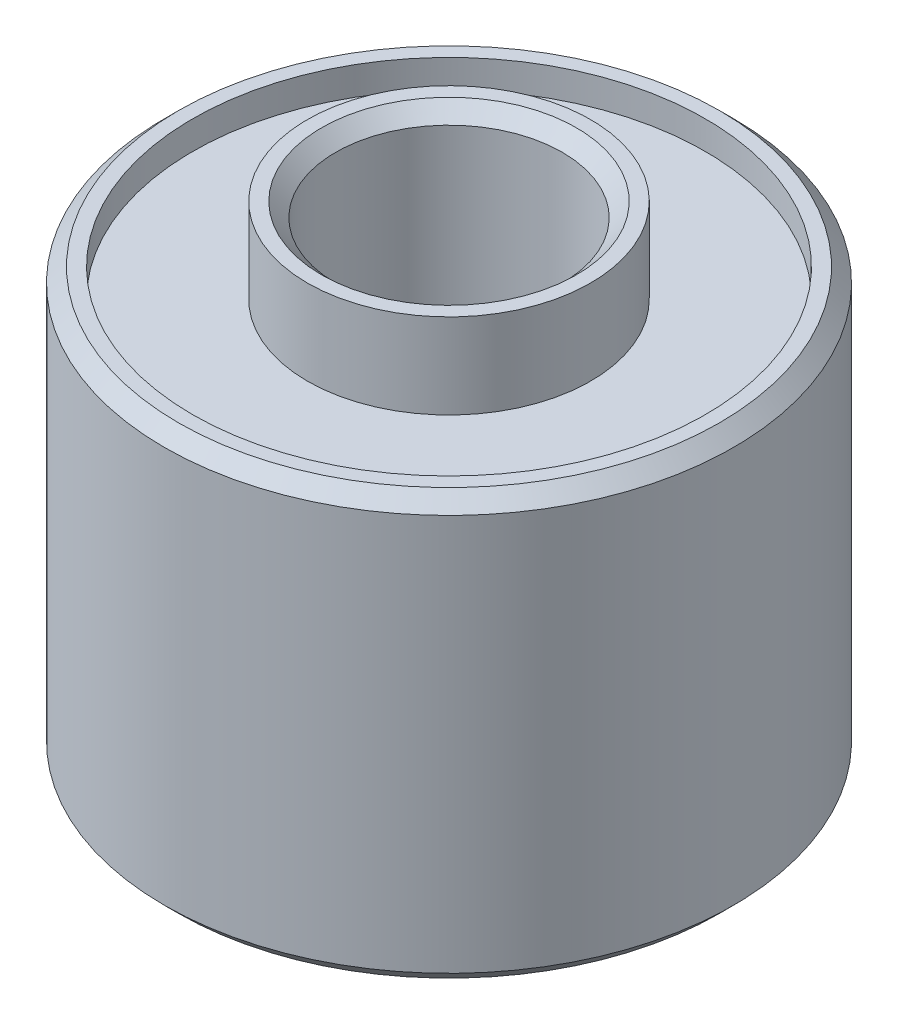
ISO-10303-21;
HEADER;
FILE_DESCRIPTION(('STEP AP214'),'2;1');
FILE_NAME('part.step','',(''),(''),'','','');
FILE_SCHEMA(('AUTOMOTIVE_DESIGN { 1 0 10303 214 1 1 1 1 }'));
ENDSEC;
DATA;
#1=APPLICATION_CONTEXT('core data for automotive mechanical design processes');
#2=APPLICATION_PROTOCOL_DEFINITION('international standard','automotive_design',2000,#1);
#3=PRODUCT_CONTEXT('',#1,'mechanical');
#4=PRODUCT('Part','Part','',(#3));
#5=PRODUCT_RELATED_PRODUCT_CATEGORY('part','',(#4));
#6=PRODUCT_DEFINITION_FORMATION('','',#4);
#7=PRODUCT_DEFINITION_CONTEXT('part definition',#1,'design');
#8=PRODUCT_DEFINITION('design','',#6,#7);
#9=PRODUCT_DEFINITION_SHAPE('','',#8);
#10=(LENGTH_UNIT() NAMED_UNIT(*) SI_UNIT(.MILLI.,.METRE.));
#11=(NAMED_UNIT(*) PLANE_ANGLE_UNIT() SI_UNIT($,.RADIAN.));
#12=(NAMED_UNIT(*) SI_UNIT($,.STERADIAN.) SOLID_ANGLE_UNIT());
#13=UNCERTAINTY_MEASURE_WITH_UNIT(LENGTH_MEASURE(1.E-05),#10,'distance_accuracy_value','');
#14=(GEOMETRIC_REPRESENTATION_CONTEXT(3) GLOBAL_UNCERTAINTY_ASSIGNED_CONTEXT((#13)) GLOBAL_UNIT_ASSIGNED_CONTEXT((#10,
#11,#12)) REPRESENTATION_CONTEXT('',''));
#15=CARTESIAN_POINT('',(0.,0.,0.));
#16=DIRECTION('',(0.,0.,1.));
#17=DIRECTION('',(1.,0.,0.));
#18=AXIS2_PLACEMENT_3D('',#15,#16,#17);
#19=CARTESIAN_POINT('',(0.,8.99999999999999,0.));
#20=DIRECTION('',(0.,1.,0.));
#21=DIRECTION('',(0.,0.,1.));
#22=AXIS2_PLACEMENT_3D('',#19,#20,#21);
#23=CONICAL_SURFACE('',#22,4.,0.785398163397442);
#24=CARTESIAN_POINT('',(0.,9.5,0.));
#25=DIRECTION('',(0.,1.,0.));
#26=DIRECTION('',(0.,0.,1.));
#27=AXIS2_PLACEMENT_3D('',#24,#25,#26);
#28=CIRCLE('',#27,4.5);
#29=CARTESIAN_POINT('',(0.,9.5,4.50000000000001));
#30=VERTEX_POINT('',#29);
#31=EDGE_CURVE('E10',#30,#30,#28,.T.);
#32=ORIENTED_EDGE('',*,*,#31,.T.);
#33=EDGE_LOOP('',(#32));
#34=FACE_BOUND('',#33,.T.);
#35=CARTESIAN_POINT('',(0.,8.99999999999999,0.));
#36=DIRECTION('',(0.,1.,0.));
#37=DIRECTION('',(0.,0.,1.));
#38=AXIS2_PLACEMENT_3D('',#35,#36,#37);
#39=CIRCLE('',#38,4.);
#40=CARTESIAN_POINT('',(0.,8.99999999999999,4.00000000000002));
#41=VERTEX_POINT('',#40);
#42=EDGE_CURVE('E80',#41,#41,#39,.T.);
#43=ORIENTED_EDGE('',*,*,#42,.F.);
#44=EDGE_LOOP('',(#43));
#45=FACE_BOUND('',#44,.T.);
#46=ADVANCED_FACE('F28',(#34,#45),#23,.F.);
#47=CARTESIAN_POINT('',(-4.49999999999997,9.5,0.));
#48=DIRECTION('',(0.,1.,0.));
#49=DIRECTION('',(0.,0.,1.));
#50=AXIS2_PLACEMENT_3D('',#47,#48,#49);
#51=PLANE('',#50);
#52=CARTESIAN_POINT('',(0.,9.5,0.));
#53=DIRECTION('',(0.,1.,0.));
#54=DIRECTION('',(0.,0.,1.));
#55=AXIS2_PLACEMENT_3D('',#52,#53,#54);
#56=CIRCLE('',#55,5.);
#57=CARTESIAN_POINT('',(0.,9.5,5.00000000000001));
#58=VERTEX_POINT('',#57);
#59=EDGE_CURVE('E34',#58,#58,#56,.T.);
#60=ORIENTED_EDGE('',*,*,#59,.T.);
#61=EDGE_LOOP('',(#60));
#62=FACE_BOUND('',#61,.T.);
#63=ORIENTED_EDGE('',*,*,#31,.F.);
#64=EDGE_LOOP('',(#63));
#65=FACE_BOUND('',#64,.T.);
#66=ADVANCED_FACE('F88',(#62,#65),#51,.T.);
#67=CARTESIAN_POINT('',(0.,0.,0.));
#68=DIRECTION('',(0.,1.,0.));
#69=DIRECTION('',(0.,0.,1.));
#70=AXIS2_PLACEMENT_3D('',#67,#68,#69);
#71=CYLINDRICAL_SURFACE('',#70,5.);
#72=CARTESIAN_POINT('',(0.,6.5,0.));
#73=DIRECTION('',(0.,1.,0.));
#74=DIRECTION('',(0.,0.,1.));
#75=AXIS2_PLACEMENT_3D('',#72,#73,#74);
#76=CIRCLE('',#75,5.);
#77=CARTESIAN_POINT('',(0.,6.5,5.00000000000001));
#78=VERTEX_POINT('',#77);
#79=EDGE_CURVE('E38',#78,#78,#76,.T.);
#80=ORIENTED_EDGE('',*,*,#79,.T.);
#81=EDGE_LOOP('',(#80));
#82=FACE_BOUND('',#81,.T.);
#83=ORIENTED_EDGE('',*,*,#59,.F.);
#84=EDGE_LOOP('',(#83));
#85=FACE_BOUND('',#84,.T.);
#86=ADVANCED_FACE('F92',(#82,#85),#71,.T.);
#87=CARTESIAN_POINT('',(-5.00000000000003,6.5,0.));
#88=DIRECTION('',(0.,1.,0.));
#89=DIRECTION('',(0.,0.,1.));
#90=AXIS2_PLACEMENT_3D('',#87,#88,#89);
#91=PLANE('',#90);
#92=CARTESIAN_POINT('',(0.,6.5,0.));
#93=DIRECTION('',(0.,1.,0.));
#94=DIRECTION('',(0.,0.,1.));
#95=AXIS2_PLACEMENT_3D('',#92,#93,#94);
#96=CIRCLE('',#95,9.05);
#97=CARTESIAN_POINT('',(0.,6.5,9.05000000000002));
#98=VERTEX_POINT('',#97);
#99=EDGE_CURVE('E42',#98,#98,#96,.T.);
#100=ORIENTED_EDGE('',*,*,#99,.T.);
#101=EDGE_LOOP('',(#100));
#102=FACE_BOUND('',#101,.T.);
#103=ORIENTED_EDGE('',*,*,#79,.F.);
#104=EDGE_LOOP('',(#103));
#105=FACE_BOUND('',#104,.T.);
#106=ADVANCED_FACE('F96',(#102,#105),#91,.T.);
#107=CARTESIAN_POINT('',(0.,0.,0.));
#108=DIRECTION('',(0.,1.,0.));
#109=DIRECTION('',(0.,0.,1.));
#110=AXIS2_PLACEMENT_3D('',#107,#108,#109);
#111=CYLINDRICAL_SURFACE('',#110,9.05);
#112=CARTESIAN_POINT('',(0.,7.5,0.));
#113=DIRECTION('',(0.,1.,0.));
#114=DIRECTION('',(0.,0.,1.));
#115=AXIS2_PLACEMENT_3D('',#112,#113,#114);
#116=CIRCLE('',#115,9.05);
#117=CARTESIAN_POINT('',(0.,7.5,9.05000000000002));
#118=VERTEX_POINT('',#117);
#119=EDGE_CURVE('E47',#118,#118,#116,.T.);
#120=ORIENTED_EDGE('',*,*,#119,.T.);
#121=EDGE_LOOP('',(#120));
#122=FACE_BOUND('',#121,.T.);
#123=ORIENTED_EDGE('',*,*,#99,.F.);
#124=EDGE_LOOP('',(#123));
#125=FACE_BOUND('',#124,.T.);
#126=ADVANCED_FACE('F103',(#122,#125),#111,.F.);
#127=CARTESIAN_POINT('',(-9.05,7.5,0.));
#128=DIRECTION('',(0.,1.,0.));
#129=DIRECTION('',(0.,0.,1.));
#130=AXIS2_PLACEMENT_3D('',#127,#128,#129);
#131=PLANE('',#130);
#132=CARTESIAN_POINT('',(0.,7.5,0.));
#133=DIRECTION('',(0.,1.,0.));
#134=DIRECTION('',(0.,0.,1.));
#135=AXIS2_PLACEMENT_3D('',#132,#133,#134);
#136=CIRCLE('',#135,9.55);
#137=CARTESIAN_POINT('',(0.,7.5,9.55000000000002));
#138=VERTEX_POINT('',#137);
#139=EDGE_CURVE('E50',#138,#138,#136,.T.);
#140=ORIENTED_EDGE('',*,*,#139,.T.);
#141=EDGE_LOOP('',(#140));
#142=FACE_BOUND('',#141,.T.);
#143=ORIENTED_EDGE('',*,*,#119,.F.);
#144=EDGE_LOOP('',(#143));
#145=FACE_BOUND('',#144,.T.);
#146=ADVANCED_FACE('F107',(#142,#145),#131,.T.);
#147=CARTESIAN_POINT('',(0.,7.5,0.));
#148=DIRECTION('',(0.,-1.,0.));
#149=DIRECTION('',(0.,0.,-1.));
#150=AXIS2_PLACEMENT_3D('',#147,#148,#149);
#151=CONICAL_SURFACE('',#150,9.55,0.785398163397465);
#152=CARTESIAN_POINT('',(0.,7.00000000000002,0.));
#153=DIRECTION('',(0.,1.,0.));
#154=DIRECTION('',(0.,0.,1.));
#155=AXIS2_PLACEMENT_3D('',#152,#153,#154);
#156=CIRCLE('',#155,10.05);
#157=CARTESIAN_POINT('',(0.,7.00000000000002,10.05));
#158=VERTEX_POINT('',#157);
#159=EDGE_CURVE('E53',#158,#158,#156,.T.);
#160=ORIENTED_EDGE('',*,*,#159,.T.);
#161=EDGE_LOOP('',(#160));
#162=FACE_BOUND('',#161,.T.);
#163=ORIENTED_EDGE('',*,*,#139,.F.);
#164=EDGE_LOOP('',(#163));
#165=FACE_BOUND('',#164,.T.);
#166=ADVANCED_FACE('F111',(#162,#165),#151,.T.);
#167=CARTESIAN_POINT('',(0.,0.,0.));
#168=DIRECTION('',(0.,1.,0.));
#169=DIRECTION('',(0.,0.,1.));
#170=AXIS2_PLACEMENT_3D('',#167,#168,#169);
#171=CYLINDRICAL_SURFACE('',#170,10.05);
#172=CARTESIAN_POINT('',(0.,-7.00000000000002,0.));
#173=DIRECTION('',(0.,1.,0.));
#174=DIRECTION('',(0.,0.,1.));
#175=AXIS2_PLACEMENT_3D('',#172,#173,#174);
#176=CIRCLE('',#175,10.05);
#177=CARTESIAN_POINT('',(0.,-7.00000000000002,10.05));
#178=VERTEX_POINT('',#177);
#179=EDGE_CURVE('E56',#178,#178,#176,.T.);
#180=ORIENTED_EDGE('',*,*,#179,.T.);
#181=EDGE_LOOP('',(#180));
#182=FACE_BOUND('',#181,.T.);
#183=ORIENTED_EDGE('',*,*,#159,.F.);
#184=EDGE_LOOP('',(#183));
#185=FACE_BOUND('',#184,.T.);
#186=ADVANCED_FACE('F115',(#182,#185),#171,.T.);
#187=CARTESIAN_POINT('',(0.,-7.00000000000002,0.));
#188=DIRECTION('',(0.,1.,0.));
#189=DIRECTION('',(0.,0.,1.));
#190=AXIS2_PLACEMENT_3D('',#187,#188,#189);
#191=CONICAL_SURFACE('',#190,10.05,0.785398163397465);
#192=CARTESIAN_POINT('',(0.,-7.5,0.));
#193=DIRECTION('',(0.,1.,0.));
#194=DIRECTION('',(0.,0.,1.));
#195=AXIS2_PLACEMENT_3D('',#192,#193,#194);
#196=CIRCLE('',#195,9.55);
#197=CARTESIAN_POINT('',(0.,-7.5,9.55000000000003));
#198=VERTEX_POINT('',#197);
#199=EDGE_CURVE('E59',#198,#198,#196,.T.);
#200=ORIENTED_EDGE('',*,*,#199,.T.);
#201=EDGE_LOOP('',(#200));
#202=FACE_BOUND('',#201,.T.);
#203=ORIENTED_EDGE('',*,*,#179,.F.);
#204=EDGE_LOOP('',(#203));
#205=FACE_BOUND('',#204,.T.);
#206=ADVANCED_FACE('F119',(#202,#205),#191,.T.);
#207=CARTESIAN_POINT('',(-9.05,-7.5,0.));
#208=DIRECTION('',(0.,-1.,0.));
#209=DIRECTION('',(0.,0.,-1.));
#210=AXIS2_PLACEMENT_3D('',#207,#208,#209);
#211=PLANE('',#210);
#212=CARTESIAN_POINT('',(0.,-7.5,0.));
#213=DIRECTION('',(0.,1.,0.));
#214=DIRECTION('',(0.,0.,1.));
#215=AXIS2_PLACEMENT_3D('',#212,#213,#214);
#216=CIRCLE('',#215,9.05);
#217=CARTESIAN_POINT('',(0.,-7.5,9.05000000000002));
#218=VERTEX_POINT('',#217);
#219=EDGE_CURVE('E62',#218,#218,#216,.T.);
#220=ORIENTED_EDGE('',*,*,#219,.T.);
#221=EDGE_LOOP('',(#220));
#222=FACE_BOUND('',#221,.T.);
#223=ORIENTED_EDGE('',*,*,#199,.F.);
#224=EDGE_LOOP('',(#223));
#225=FACE_BOUND('',#224,.T.);
#226=ADVANCED_FACE('F123',(#222,#225),#211,.T.);
#227=CARTESIAN_POINT('',(0.,0.,0.));
#228=DIRECTION('',(0.,1.,0.));
#229=DIRECTION('',(0.,0.,1.));
#230=AXIS2_PLACEMENT_3D('',#227,#228,#229);
#231=CYLINDRICAL_SURFACE('',#230,9.05);
#232=CARTESIAN_POINT('',(0.,-6.5,0.));
#233=DIRECTION('',(0.,1.,0.));
#234=DIRECTION('',(0.,0.,1.));
#235=AXIS2_PLACEMENT_3D('',#232,#233,#234);
#236=CIRCLE('',#235,9.05);
#237=CARTESIAN_POINT('',(0.,-6.5,9.05000000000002));
#238=VERTEX_POINT('',#237);
#239=EDGE_CURVE('E65',#238,#238,#236,.T.);
#240=ORIENTED_EDGE('',*,*,#239,.T.);
#241=EDGE_LOOP('',(#240));
#242=FACE_BOUND('',#241,.T.);
#243=ORIENTED_EDGE('',*,*,#219,.F.);
#244=EDGE_LOOP('',(#243));
#245=FACE_BOUND('',#244,.T.);
#246=ADVANCED_FACE('F127',(#242,#245),#231,.F.);
#247=CARTESIAN_POINT('',(-5.00000000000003,-6.5,0.));
#248=DIRECTION('',(0.,-1.,0.));
#249=DIRECTION('',(0.,0.,-1.));
#250=AXIS2_PLACEMENT_3D('',#247,#248,#249);
#251=PLANE('',#250);
#252=CARTESIAN_POINT('',(0.,-6.5,0.));
#253=DIRECTION('',(0.,1.,0.));
#254=DIRECTION('',(0.,0.,1.));
#255=AXIS2_PLACEMENT_3D('',#252,#253,#254);
#256=CIRCLE('',#255,5.);
#257=CARTESIAN_POINT('',(0.,-6.5,5.00000000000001));
#258=VERTEX_POINT('',#257);
#259=EDGE_CURVE('E68',#258,#258,#256,.T.);
#260=ORIENTED_EDGE('',*,*,#259,.T.);
#261=EDGE_LOOP('',(#260));
#262=FACE_BOUND('',#261,.T.);
#263=ORIENTED_EDGE('',*,*,#239,.F.);
#264=EDGE_LOOP('',(#263));
#265=FACE_BOUND('',#264,.T.);
#266=ADVANCED_FACE('F131',(#262,#265),#251,.T.);
#267=CARTESIAN_POINT('',(0.,0.,0.));
#268=DIRECTION('',(0.,1.,0.));
#269=DIRECTION('',(0.,0.,1.));
#270=AXIS2_PLACEMENT_3D('',#267,#268,#269);
#271=CYLINDRICAL_SURFACE('',#270,5.);
#272=CARTESIAN_POINT('',(0.,-9.5,0.));
#273=DIRECTION('',(0.,1.,0.));
#274=DIRECTION('',(0.,0.,1.));
#275=AXIS2_PLACEMENT_3D('',#272,#273,#274);
#276=CIRCLE('',#275,5.);
#277=CARTESIAN_POINT('',(0.,-9.5,5.00000000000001));
#278=VERTEX_POINT('',#277);
#279=EDGE_CURVE('E71',#278,#278,#276,.T.);
#280=ORIENTED_EDGE('',*,*,#279,.T.);
#281=EDGE_LOOP('',(#280));
#282=FACE_BOUND('',#281,.T.);
#283=ORIENTED_EDGE('',*,*,#259,.F.);
#284=EDGE_LOOP('',(#283));
#285=FACE_BOUND('',#284,.T.);
#286=ADVANCED_FACE('F135',(#282,#285),#271,.T.);
#287=CARTESIAN_POINT('',(-4.5,-9.5,0.));
#288=DIRECTION('',(0.,-1.,0.));
#289=DIRECTION('',(0.,0.,-1.));
#290=AXIS2_PLACEMENT_3D('',#287,#288,#289);
#291=PLANE('',#290);
#292=CARTESIAN_POINT('',(0.,-9.5,0.));
#293=DIRECTION('',(0.,1.,0.));
#294=DIRECTION('',(0.,0.,1.));
#295=AXIS2_PLACEMENT_3D('',#292,#293,#294);
#296=CIRCLE('',#295,4.5);
#297=CARTESIAN_POINT('',(0.,-9.5,4.50000000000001));
#298=VERTEX_POINT('',#297);
#299=EDGE_CURVE('E74',#298,#298,#296,.T.);
#300=ORIENTED_EDGE('',*,*,#299,.T.);
#301=EDGE_LOOP('',(#300));
#302=FACE_BOUND('',#301,.T.);
#303=ORIENTED_EDGE('',*,*,#279,.F.);
#304=EDGE_LOOP('',(#303));
#305=FACE_BOUND('',#304,.T.);
#306=ADVANCED_FACE('F139',(#302,#305),#291,.T.);
#307=CARTESIAN_POINT('',(0.,-9.5,0.));
#308=DIRECTION('',(0.,-1.,0.));
#309=DIRECTION('',(0.,0.,-1.));
#310=AXIS2_PLACEMENT_3D('',#307,#308,#309);
#311=CONICAL_SURFACE('',#310,4.5,0.785398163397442);
#312=CARTESIAN_POINT('',(0.,-8.99999999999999,0.));
#313=DIRECTION('',(0.,1.,0.));
#314=DIRECTION('',(0.,0.,1.));
#315=AXIS2_PLACEMENT_3D('',#312,#313,#314);
#316=CIRCLE('',#315,4.);
#317=CARTESIAN_POINT('',(0.,-8.99999999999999,4.00000000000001));
#318=VERTEX_POINT('',#317);
#319=EDGE_CURVE('E77',#318,#318,#316,.T.);
#320=ORIENTED_EDGE('',*,*,#319,.T.);
#321=EDGE_LOOP('',(#320));
#322=FACE_BOUND('',#321,.T.);
#323=ORIENTED_EDGE('',*,*,#299,.F.);
#324=EDGE_LOOP('',(#323));
#325=FACE_BOUND('',#324,.T.);
#326=ADVANCED_FACE('F143',(#322,#325),#311,.F.);
#327=CARTESIAN_POINT('',(0.,0.,0.));
#328=DIRECTION('',(0.,1.,0.));
#329=DIRECTION('',(0.,0.,1.));
#330=AXIS2_PLACEMENT_3D('',#327,#328,#329);
#331=CYLINDRICAL_SURFACE('',#330,4.);
#332=ORIENTED_EDGE('',*,*,#42,.T.);
#333=EDGE_LOOP('',(#332));
#334=FACE_BOUND('',#333,.T.);
#335=ORIENTED_EDGE('',*,*,#319,.F.);
#336=EDGE_LOOP('',(#335));
#337=FACE_BOUND('',#336,.T.);
#338=ADVANCED_FACE('F84',(#334,#337),#331,.F.);
#339=CLOSED_SHELL('',(#46,#66,#86,#106,#126,#146,#166,#186,#206,#226,#246,#266,#286,#306,#326,#338));
#340=MANIFOLD_SOLID_BREP('B2',#339);
#341=ADVANCED_BREP_SHAPE_REPRESENTATION('',(#18,#340),#14);
#342=SHAPE_DEFINITION_REPRESENTATION(#9,#341);
ENDSEC;
END-ISO-10303-21;
